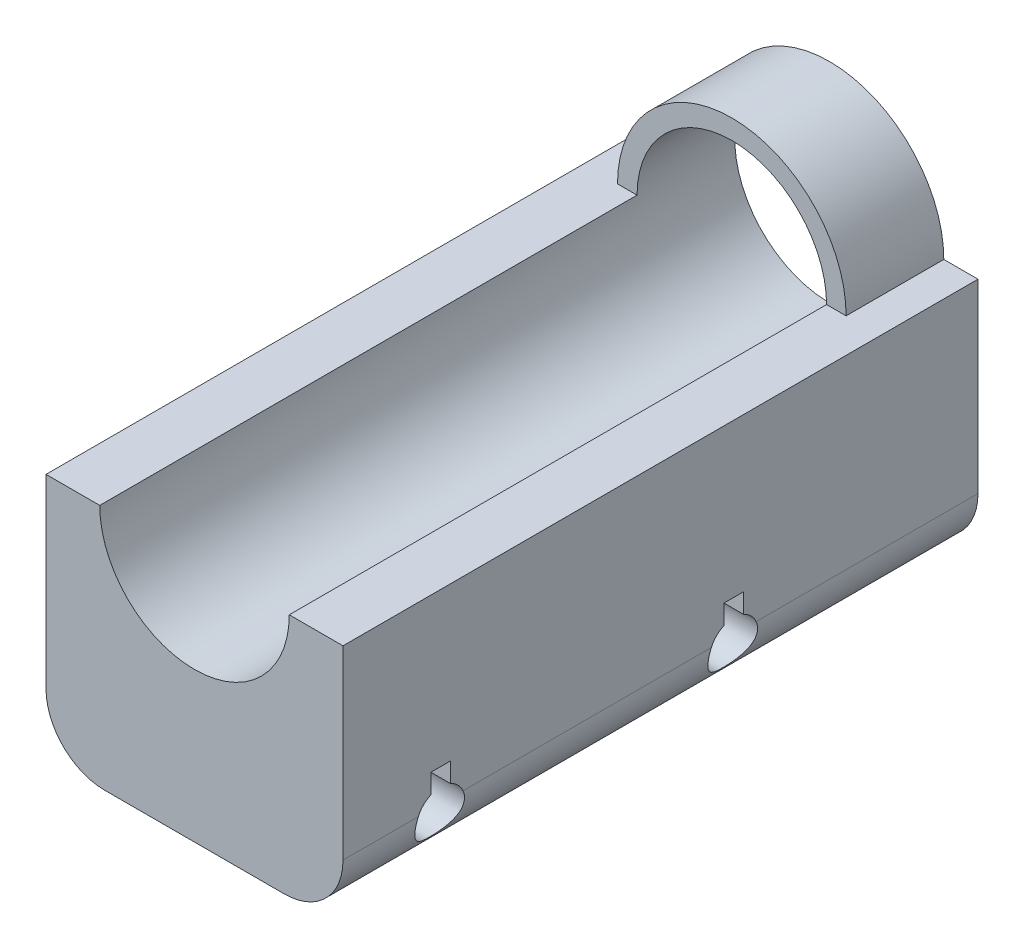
ISO-10303-21;
HEADER;
FILE_DESCRIPTION(('STEP AP214'),'2;1');
FILE_NAME('part.step','',(''),(''),'','','');
FILE_SCHEMA(('AUTOMOTIVE_DESIGN { 1 0 10303 214 1 1 1 1 }'));
ENDSEC;
DATA;
#1=APPLICATION_CONTEXT('core data for automotive mechanical design processes');
#2=APPLICATION_PROTOCOL_DEFINITION('international standard','automotive_design',2000,#1);
#3=PRODUCT_CONTEXT('',#1,'mechanical');
#4=PRODUCT('Part','Part','',(#3));
#5=PRODUCT_RELATED_PRODUCT_CATEGORY('part','',(#4));
#6=PRODUCT_DEFINITION_FORMATION('','',#4);
#7=PRODUCT_DEFINITION_CONTEXT('part definition',#1,'design');
#8=PRODUCT_DEFINITION('design','',#6,#7);
#9=PRODUCT_DEFINITION_SHAPE('','',#8);
#10=(LENGTH_UNIT() NAMED_UNIT(*) SI_UNIT(.MILLI.,.METRE.));
#11=(NAMED_UNIT(*) PLANE_ANGLE_UNIT() SI_UNIT($,.RADIAN.));
#12=(NAMED_UNIT(*) SI_UNIT($,.STERADIAN.) SOLID_ANGLE_UNIT());
#13=UNCERTAINTY_MEASURE_WITH_UNIT(LENGTH_MEASURE(1.E-05),#10,'distance_accuracy_value','');
#14=(GEOMETRIC_REPRESENTATION_CONTEXT(3) GLOBAL_UNCERTAINTY_ASSIGNED_CONTEXT((#13)) GLOBAL_UNIT_ASSIGNED_CONTEXT((#10,
#11,#12)) REPRESENTATION_CONTEXT('',''));
#15=CARTESIAN_POINT('',(0.,0.,0.));
#16=DIRECTION('',(0.,0.,1.));
#17=DIRECTION('',(1.,0.,0.));
#18=AXIS2_PLACEMENT_3D('',#15,#16,#17);
#19=CARTESIAN_POINT('',(38.608,7.62000000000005,82.55));
#20=DIRECTION('',(-1.,0.,0.));
#21=DIRECTION('',(0.,0.,1.));
#22=AXIS2_PLACEMENT_3D('',#19,#20,#21);
#23=PLANE('',#22);
#24=DIRECTION('',(0.,-1.,0.));
#25=VECTOR('',#24,1.);
#26=CARTESIAN_POINT('',(38.608,9.25993556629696,68.58));
#27=LINE('',#26,#25);
#28=CARTESIAN_POINT('',(38.608,11.799935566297,68.58));
#29=VERTEX_POINT('',#28);
#30=CARTESIAN_POINT('',(38.608,9.25993556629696,68.58));
#31=VERTEX_POINT('',#30);
#32=EDGE_CURVE('E193',#29,#31,#27,.T.);
#33=ORIENTED_EDGE('',*,*,#32,.T.);
#34=CARTESIAN_POINT('',(38.608,6.35,69.85));
#35=DIRECTION('',(-1.,0.,0.));
#36=DIRECTION('',(0.,0.,1.));
#37=AXIS2_PLACEMENT_3D('',#34,#35,#36);
#38=CIRCLE('',#37,3.175);
#39=CARTESIAN_POINT('',(38.608,7.62,66.940064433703));
#40=VERTEX_POINT('',#39);
#41=EDGE_CURVE('E202',#31,#40,#38,.T.);
#42=ORIENTED_EDGE('',*,*,#41,.T.);
#43=DIRECTION('',(0.,0.,-1.));
#44=VECTOR('',#43,1.);
#45=CARTESIAN_POINT('',(38.608,7.62000000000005,82.55));
#46=LINE('',#45,#44);
#47=CARTESIAN_POINT('',(38.608,7.62000000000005,34.659935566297));
#48=VERTEX_POINT('',#47);
#49=EDGE_CURVE('E342',#40,#48,#46,.T.);
#50=ORIENTED_EDGE('',*,*,#49,.T.);
#51=CARTESIAN_POINT('',(38.608,6.35,31.75));
#52=DIRECTION('',(-1.,0.,0.));
#53=DIRECTION('',(0.,0.,1.));
#54=AXIS2_PLACEMENT_3D('',#51,#52,#53);
#55=CIRCLE('',#54,3.175);
#56=CARTESIAN_POINT('',(38.608,9.25993556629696,33.02));
#57=VERTEX_POINT('',#56);
#58=EDGE_CURVE('E374',#48,#57,#55,.T.);
#59=ORIENTED_EDGE('',*,*,#58,.T.);
#60=DIRECTION('',(0.,1.,0.));
#61=VECTOR('',#60,1.);
#62=CARTESIAN_POINT('',(38.608,11.799935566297,33.02));
#63=LINE('',#62,#61);
#64=CARTESIAN_POINT('',(38.608,11.799935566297,33.02));
#65=VERTEX_POINT('',#64);
#66=EDGE_CURVE('E378',#57,#65,#63,.T.);
#67=ORIENTED_EDGE('',*,*,#66,.T.);
#68=DIRECTION('',(0.,0.,-1.));
#69=VECTOR('',#68,1.);
#70=CARTESIAN_POINT('',(38.608,11.799935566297,30.48));
#71=LINE('',#70,#69);
#72=CARTESIAN_POINT('',(38.608,11.799935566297,30.48));
#73=VERTEX_POINT('',#72);
#74=EDGE_CURVE('E380',#65,#73,#71,.T.);
#75=ORIENTED_EDGE('',*,*,#74,.T.);
#76=DIRECTION('',(0.,-1.,0.));
#77=VECTOR('',#76,1.);
#78=CARTESIAN_POINT('',(38.608,9.25993556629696,30.48));
#79=LINE('',#78,#77);
#80=CARTESIAN_POINT('',(38.608,9.25993556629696,30.48));
#81=VERTEX_POINT('',#80);
#82=EDGE_CURVE('E377',#73,#81,#79,.T.);
#83=ORIENTED_EDGE('',*,*,#82,.T.);
#84=CARTESIAN_POINT('',(38.608,7.62,28.840064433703));
#85=VERTEX_POINT('',#84);
#86=EDGE_CURVE('E235',#81,#85,#55,.T.);
#87=ORIENTED_EDGE('',*,*,#86,.T.);
#88=CARTESIAN_POINT('',(38.608,7.62000000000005,0.));
#89=VERTEX_POINT('',#88);
#90=EDGE_CURVE('E321',#85,#89,#46,.T.);
#91=ORIENTED_EDGE('',*,*,#90,.T.);
#92=DIRECTION('',(0.,1.,0.));
#93=VECTOR('',#92,1.);
#94=CARTESIAN_POINT('',(38.608,7.62000000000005,0.));
#95=LINE('',#94,#93);
#96=CARTESIAN_POINT('',(38.608,31.75,0.));
#97=VERTEX_POINT('',#96);
#98=EDGE_CURVE('E300',#89,#97,#95,.T.);
#99=ORIENTED_EDGE('',*,*,#98,.T.);
#100=DIRECTION('',(0.,0.,-1.));
#101=VECTOR('',#100,1.);
#102=CARTESIAN_POINT('',(38.608,31.75,82.55));
#103=LINE('',#102,#101);
#104=CARTESIAN_POINT('',(38.608,31.75,82.55));
#105=VERTEX_POINT('',#104);
#106=EDGE_CURVE('E360',#105,#97,#103,.T.);
#107=ORIENTED_EDGE('',*,*,#106,.F.);
#108=DIRECTION('',(0.,1.,0.));
#109=VECTOR('',#108,1.);
#110=CARTESIAN_POINT('',(38.608,7.62000000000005,82.55));
#111=LINE('',#110,#109);
#112=CARTESIAN_POINT('',(38.608,7.62000000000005,82.55));
#113=VERTEX_POINT('',#112);
#114=EDGE_CURVE('E303',#113,#105,#111,.T.);
#115=ORIENTED_EDGE('',*,*,#114,.F.);
#116=CARTESIAN_POINT('',(38.608,7.62000000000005,72.7599355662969));
#117=VERTEX_POINT('',#116);
#118=EDGE_CURVE('E208',#113,#117,#46,.T.);
#119=ORIENTED_EDGE('',*,*,#118,.T.);
#120=CARTESIAN_POINT('',(38.608,9.25993556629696,71.12));
#121=VERTEX_POINT('',#120);
#122=EDGE_CURVE('E61',#117,#121,#38,.T.);
#123=ORIENTED_EDGE('',*,*,#122,.T.);
#124=DIRECTION('',(0.,1.,0.));
#125=VECTOR('',#124,1.);
#126=CARTESIAN_POINT('',(38.608,11.799935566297,71.12));
#127=LINE('',#126,#125);
#128=CARTESIAN_POINT('',(38.608,11.799935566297,71.12));
#129=VERTEX_POINT('',#128);
#130=EDGE_CURVE('E196',#121,#129,#127,.T.);
#131=ORIENTED_EDGE('',*,*,#130,.T.);
#132=DIRECTION('',(0.,0.,-1.));
#133=VECTOR('',#132,1.);
#134=CARTESIAN_POINT('',(38.608,11.799935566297,68.58));
#135=LINE('',#134,#133);
#136=EDGE_CURVE('E201',#129,#29,#135,.T.);
#137=ORIENTED_EDGE('',*,*,#136,.T.);
#138=EDGE_LOOP('',(#33,#42,#50,#59,#67,#75,#83,#87,#91,#99,#107,#115,#119,#123,#131,#137));
#139=FACE_BOUND('',#138,.T.);
#140=ADVANCED_FACE('F35',(#139),#23,.F.);
#141=CARTESIAN_POINT('',(31.623,31.75,82.55));
#142=DIRECTION('',(0.,-1.,0.));
#143=DIRECTION('',(0.,0.,-1.));
#144=AXIS2_PLACEMENT_3D('',#141,#142,#143);
#145=PLANE('',#144);
#146=DIRECTION('',(-1.,0.,0.));
#147=VECTOR('',#146,1.);
#148=CARTESIAN_POINT('',(31.623,31.75,0.));
#149=LINE('',#148,#147);
#150=CARTESIAN_POINT('',(34.163,31.75,0.));
#151=VERTEX_POINT('',#150);
#152=EDGE_CURVE('E324',#97,#151,#149,.T.);
#153=ORIENTED_EDGE('',*,*,#152,.T.);
#154=DIRECTION('',(0.,0.,-1.));
#155=VECTOR('',#154,1.);
#156=CARTESIAN_POINT('',(34.163,31.75,12.7));
#157=LINE('',#156,#155);
#158=CARTESIAN_POINT('',(34.163,31.75,12.7));
#159=VERTEX_POINT('',#158);
#160=EDGE_CURVE('E294',#159,#151,#157,.T.);
#161=ORIENTED_EDGE('',*,*,#160,.F.);
#162=DIRECTION('',(-1.,0.,0.));
#163=VECTOR('',#162,1.);
#164=CARTESIAN_POINT('',(31.623,31.75,12.7));
#165=LINE('',#164,#163);
#166=CARTESIAN_POINT('',(31.623,31.75,12.7));
#167=VERTEX_POINT('',#166);
#168=EDGE_CURVE('E287',#159,#167,#165,.T.);
#169=ORIENTED_EDGE('',*,*,#168,.T.);
#170=DIRECTION('',(0.,0.,-1.));
#171=VECTOR('',#170,1.);
#172=CARTESIAN_POINT('',(31.623,31.75,82.55));
#173=LINE('',#172,#171);
#174=CARTESIAN_POINT('',(31.623,31.75,82.55));
#175=VERTEX_POINT('',#174);
#176=EDGE_CURVE('E358',#175,#167,#173,.T.);
#177=ORIENTED_EDGE('',*,*,#176,.F.);
#178=DIRECTION('',(-1.,0.,0.));
#179=VECTOR('',#178,1.);
#180=CARTESIAN_POINT('',(31.623,31.75,82.55));
#181=LINE('',#180,#179);
#182=EDGE_CURVE('E306',#105,#175,#181,.T.);
#183=ORIENTED_EDGE('',*,*,#182,.F.);
#184=ORIENTED_EDGE('',*,*,#106,.T.);
#185=EDGE_LOOP('',(#153,#161,#169,#177,#183,#184));
#186=FACE_BOUND('',#185,.T.);
#187=ADVANCED_FACE('F441',(#186),#145,.F.);
#188=CARTESIAN_POINT('',(19.304,31.75,82.55));
#189=DIRECTION('',(0.,0.,-1.));
#190=DIRECTION('',(-1.,0.,0.));
#191=AXIS2_PLACEMENT_3D('',#188,#189,#190);
#192=CYLINDRICAL_SURFACE('',#191,12.319);
#193=CARTESIAN_POINT('',(19.304,31.75,0.));
#194=DIRECTION('',(0.,0.,-1.));
#195=DIRECTION('',(1.,0.,0.));
#196=AXIS2_PLACEMENT_3D('',#193,#194,#195);
#197=CIRCLE('',#196,12.319);
#198=CARTESIAN_POINT('',(31.623,31.75,0.));
#199=VERTEX_POINT('',#198);
#200=EDGE_CURVE('E326',#199,#199,#197,.T.);
#201=ORIENTED_EDGE('',*,*,#200,.T.);
#202=EDGE_LOOP('',(#201));
#203=FACE_BOUND('',#202,.T.);
#204=ORIENTED_EDGE('',*,*,#176,.T.);
#205=CARTESIAN_POINT('',(19.304,31.75,12.7));
#206=DIRECTION('',(0.,0.,1.));
#207=DIRECTION('',(-1.,0.,0.));
#208=AXIS2_PLACEMENT_3D('',#205,#206,#207);
#209=CIRCLE('',#208,12.319);
#210=CARTESIAN_POINT('',(6.985,31.75,12.7));
#211=VERTEX_POINT('',#210);
#212=EDGE_CURVE('E289',#167,#211,#209,.T.);
#213=ORIENTED_EDGE('',*,*,#212,.T.);
#214=DIRECTION('',(0.,0.,-1.));
#215=VECTOR('',#214,1.);
#216=CARTESIAN_POINT('',(6.985,31.75,82.55));
#217=LINE('',#216,#215);
#218=CARTESIAN_POINT('',(6.985,31.75,82.55));
#219=VERTEX_POINT('',#218);
#220=EDGE_CURVE('E356',#219,#211,#217,.T.);
#221=ORIENTED_EDGE('',*,*,#220,.F.);
#222=CARTESIAN_POINT('',(19.304,31.75,82.55));
#223=DIRECTION('',(0.,0.,-1.));
#224=DIRECTION('',(1.,0.,0.));
#225=AXIS2_PLACEMENT_3D('',#222,#223,#224);
#226=CIRCLE('',#225,12.319);
#227=EDGE_CURVE('E309',#175,#219,#226,.T.);
#228=ORIENTED_EDGE('',*,*,#227,.F.);
#229=EDGE_LOOP('',(#204,#213,#221,#228));
#230=FACE_BOUND('',#229,.T.);
#231=ADVANCED_FACE('F445',(#203,#230),#192,.F.);
#232=CARTESIAN_POINT('',(0.,31.75,82.55));
#233=DIRECTION('',(0.,-1.,0.));
#234=DIRECTION('',(0.,0.,-1.));
#235=AXIS2_PLACEMENT_3D('',#232,#233,#234);
#236=PLANE('',#235);
#237=DIRECTION('',(-1.,0.,0.));
#238=VECTOR('',#237,1.);
#239=CARTESIAN_POINT('',(4.445,31.75,12.7));
#240=LINE('',#239,#238);
#241=CARTESIAN_POINT('',(4.445,31.75,12.7));
#242=VERTEX_POINT('',#241);
#243=EDGE_CURVE('E292',#211,#242,#240,.T.);
#244=ORIENTED_EDGE('',*,*,#243,.T.);
#245=DIRECTION('',(0.,0.,-1.));
#246=VECTOR('',#245,1.);
#247=CARTESIAN_POINT('',(4.445,31.75,12.7));
#248=LINE('',#247,#246);
#249=CARTESIAN_POINT('',(4.445,31.75,0.));
#250=VERTEX_POINT('',#249);
#251=EDGE_CURVE('E297',#242,#250,#248,.T.);
#252=ORIENTED_EDGE('',*,*,#251,.T.);
#253=DIRECTION('',(-1.,0.,0.));
#254=VECTOR('',#253,1.);
#255=CARTESIAN_POINT('',(0.,31.75,0.));
#256=LINE('',#255,#254);
#257=CARTESIAN_POINT('',(0.,31.75,0.));
#258=VERTEX_POINT('',#257);
#259=EDGE_CURVE('E329',#250,#258,#256,.T.);
#260=ORIENTED_EDGE('',*,*,#259,.T.);
#261=DIRECTION('',(0.,0.,-1.));
#262=VECTOR('',#261,1.);
#263=CARTESIAN_POINT('',(0.,31.75,82.55));
#264=LINE('',#263,#262);
#265=CARTESIAN_POINT('',(0.,31.75,82.55));
#266=VERTEX_POINT('',#265);
#267=EDGE_CURVE('E352',#266,#258,#264,.T.);
#268=ORIENTED_EDGE('',*,*,#267,.F.);
#269=DIRECTION('',(-1.,0.,0.));
#270=VECTOR('',#269,1.);
#271=CARTESIAN_POINT('',(0.,31.75,82.55));
#272=LINE('',#271,#270);
#273=EDGE_CURVE('E311',#219,#266,#272,.T.);
#274=ORIENTED_EDGE('',*,*,#273,.F.);
#275=ORIENTED_EDGE('',*,*,#220,.T.);
#276=EDGE_LOOP('',(#244,#252,#260,#268,#274,#275));
#277=FACE_BOUND('',#276,.T.);
#278=ADVANCED_FACE('F449',(#277),#236,.F.);
#279=CARTESIAN_POINT('',(0.,7.62000000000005,82.55));
#280=DIRECTION('',(1.,0.,0.));
#281=DIRECTION('',(0.,0.,-1.));
#282=AXIS2_PLACEMENT_3D('',#279,#280,#281);
#283=PLANE('',#282);
#284=DIRECTION('',(0.,1.,0.));
#285=VECTOR('',#284,1.);
#286=CARTESIAN_POINT('',(0.,11.799935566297,71.12));
#287=LINE('',#286,#285);
#288=CARTESIAN_POINT('',(0.,9.25993556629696,71.12));
#289=VERTEX_POINT('',#288);
#290=CARTESIAN_POINT('',(0.,11.799935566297,71.12));
#291=VERTEX_POINT('',#290);
#292=EDGE_CURVE('E219',#289,#291,#287,.T.);
#293=ORIENTED_EDGE('',*,*,#292,.F.);
#294=CARTESIAN_POINT('',(0.,6.35,69.85));
#295=DIRECTION('',(-1.,0.,0.));
#296=DIRECTION('',(0.,0.,1.));
#297=AXIS2_PLACEMENT_3D('',#294,#295,#296);
#298=CIRCLE('',#297,3.175);
#299=CARTESIAN_POINT('',(0.,7.62,72.7599355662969));
#300=VERTEX_POINT('',#299);
#301=EDGE_CURVE('E188',#300,#289,#298,.T.);
#302=ORIENTED_EDGE('',*,*,#301,.F.);
#303=DIRECTION('',(0.,0.,-1.));
#304=VECTOR('',#303,1.);
#305=CARTESIAN_POINT('',(0.,7.62000000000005,82.55));
#306=LINE('',#305,#304);
#307=CARTESIAN_POINT('',(0.,7.62000000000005,82.55));
#308=VERTEX_POINT('',#307);
#309=EDGE_CURVE('E349',#308,#300,#306,.T.);
#310=ORIENTED_EDGE('',*,*,#309,.F.);
#311=DIRECTION('',(0.,-1.,0.));
#312=VECTOR('',#311,1.);
#313=CARTESIAN_POINT('',(0.,7.62000000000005,82.55));
#314=LINE('',#313,#312);
#315=EDGE_CURVE('E313',#266,#308,#314,.T.);
#316=ORIENTED_EDGE('',*,*,#315,.F.);
#317=ORIENTED_EDGE('',*,*,#267,.T.);
#318=DIRECTION('',(0.,-1.,0.));
#319=VECTOR('',#318,1.);
#320=CARTESIAN_POINT('',(0.,7.62000000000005,0.));
#321=LINE('',#320,#319);
#322=CARTESIAN_POINT('',(0.,7.62000000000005,0.));
#323=VERTEX_POINT('',#322);
#324=EDGE_CURVE('E331',#258,#323,#321,.T.);
#325=ORIENTED_EDGE('',*,*,#324,.T.);
#326=CARTESIAN_POINT('',(0.,7.62000000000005,28.840064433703));
#327=VERTEX_POINT('',#326);
#328=EDGE_CURVE('E348',#327,#323,#306,.T.);
#329=ORIENTED_EDGE('',*,*,#328,.F.);
#330=CARTESIAN_POINT('',(0.,6.35,31.75));
#331=DIRECTION('',(-1.,0.,0.));
#332=DIRECTION('',(0.,0.,1.));
#333=AXIS2_PLACEMENT_3D('',#330,#331,#332);
#334=CIRCLE('',#333,3.175);
#335=CARTESIAN_POINT('',(0.,9.25993556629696,30.48));
#336=VERTEX_POINT('',#335);
#337=EDGE_CURVE('E403',#336,#327,#334,.T.);
#338=ORIENTED_EDGE('',*,*,#337,.F.);
#339=DIRECTION('',(0.,-1.,0.));
#340=VECTOR('',#339,1.);
#341=CARTESIAN_POINT('',(0.,9.25993556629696,30.48));
#342=LINE('',#341,#340);
#343=CARTESIAN_POINT('',(0.,11.799935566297,30.48));
#344=VERTEX_POINT('',#343);
#345=EDGE_CURVE('E381',#344,#336,#342,.T.);
#346=ORIENTED_EDGE('',*,*,#345,.F.);
#347=DIRECTION('',(0.,0.,-1.));
#348=VECTOR('',#347,1.);
#349=CARTESIAN_POINT('',(0.,11.799935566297,30.48));
#350=LINE('',#349,#348);
#351=CARTESIAN_POINT('',(0.,11.799935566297,33.02));
#352=VERTEX_POINT('',#351);
#353=EDGE_CURVE('E383',#352,#344,#350,.T.);
#354=ORIENTED_EDGE('',*,*,#353,.F.);
#355=DIRECTION('',(0.,1.,0.));
#356=VECTOR('',#355,1.);
#357=CARTESIAN_POINT('',(0.,11.799935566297,33.02));
#358=LINE('',#357,#356);
#359=CARTESIAN_POINT('',(0.,9.25993556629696,33.02));
#360=VERTEX_POINT('',#359);
#361=EDGE_CURVE('E388',#360,#352,#358,.T.);
#362=ORIENTED_EDGE('',*,*,#361,.F.);
#363=CARTESIAN_POINT('',(0.,7.62,34.659935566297));
#364=VERTEX_POINT('',#363);
#365=EDGE_CURVE('E234',#364,#360,#334,.T.);
#366=ORIENTED_EDGE('',*,*,#365,.F.);
#367=CARTESIAN_POINT('',(0.,7.62000000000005,66.940064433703));
#368=VERTEX_POINT('',#367);
#369=EDGE_CURVE('E353',#368,#364,#306,.T.);
#370=ORIENTED_EDGE('',*,*,#369,.F.);
#371=CARTESIAN_POINT('',(0.,9.25993556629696,68.58));
#372=VERTEX_POINT('',#371);
#373=EDGE_CURVE('E54',#372,#368,#298,.T.);
#374=ORIENTED_EDGE('',*,*,#373,.F.);
#375=DIRECTION('',(0.,-1.,0.));
#376=VECTOR('',#375,1.);
#377=CARTESIAN_POINT('',(0.,9.25993556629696,68.58));
#378=LINE('',#377,#376);
#379=CARTESIAN_POINT('',(0.,11.799935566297,68.58));
#380=VERTEX_POINT('',#379);
#381=EDGE_CURVE('E209',#380,#372,#378,.T.);
#382=ORIENTED_EDGE('',*,*,#381,.F.);
#383=DIRECTION('',(0.,0.,-1.));
#384=VECTOR('',#383,1.);
#385=CARTESIAN_POINT('',(0.,11.799935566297,68.58));
#386=LINE('',#385,#384);
#387=EDGE_CURVE('E213',#291,#380,#386,.T.);
#388=ORIENTED_EDGE('',*,*,#387,.F.);
#389=EDGE_LOOP('',(#293,#302,#310,#316,#317,#325,#329,#338,#346,#354,#362,#366,#370,#374,#382,#388));
#390=FACE_BOUND('',#389,.T.);
#391=ADVANCED_FACE('F407',(#390),#283,.F.);
#392=CARTESIAN_POINT('',(7.62,7.62,82.55));
#393=DIRECTION('',(0.,0.,-1.));
#394=DIRECTION('',(-1.,0.,0.));
#395=AXIS2_PLACEMENT_3D('',#392,#393,#394);
#396=CYLINDRICAL_SURFACE('',#395,7.62);
#397=ORIENTED_EDGE('',*,*,#309,.T.);
#398=CARTESIAN_POINT('',(0.178561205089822,9.25993556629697,71.12));
#399=CARTESIAN_POINT('',(0.170687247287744,9.22418125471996,71.2019183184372));
#400=CARTESIAN_POINT('',(0.162318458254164,9.18500593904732,71.2822445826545));
#401=CARTESIAN_POINT('',(0.144994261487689,9.10006394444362,71.4392607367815));
#402=CARTESIAN_POINT('',(0.13603889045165,9.05429767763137,71.515950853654));
#403=CARTESIAN_POINT('',(0.108897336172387,8.90748937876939,71.7398909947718));
#404=CARTESIAN_POINT('',(0.0904342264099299,8.79693164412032,71.8810249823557));
#405=CARTESIAN_POINT('',(0.0563898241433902,8.55343318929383,72.1429323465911));
#406=CARTESIAN_POINT('',(0.0408104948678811,8.42047733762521,72.2636918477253));
#407=CARTESIAN_POINT('',(0.0161377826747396,8.13578269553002,72.4812817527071));
#408=CARTESIAN_POINT('',(0.007039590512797,7.98405793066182,72.5781298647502));
#409=CARTESIAN_POINT('',(-0.00142698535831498,7.66952754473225,72.743155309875));
#410=CARTESIAN_POINT('',(-0.000995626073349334,7.5070214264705,72.8118918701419));
#411=CARTESIAN_POINT('',(0.0112778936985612,7.17324843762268,72.9214348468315));
#412=CARTESIAN_POINT('',(0.0231180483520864,7.00198311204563,72.962246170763));
#413=CARTESIAN_POINT('',(0.0582997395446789,6.66478635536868,73.0137339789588));
#414=CARTESIAN_POINT('',(0.0810545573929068,6.49900002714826,73.0257781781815));
#415=CARTESIAN_POINT('',(0.13746797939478,6.16946058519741,73.0241434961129));
#416=CARTESIAN_POINT('',(0.171126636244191,6.00570748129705,73.0104644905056));
#417=CARTESIAN_POINT('',(0.248475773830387,5.68275497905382,72.95845050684));
#418=CARTESIAN_POINT('',(0.292270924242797,5.52362408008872,72.9198501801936));
#419=CARTESIAN_POINT('',(0.387599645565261,5.21523928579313,72.8197229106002));
#420=CARTESIAN_POINT('',(0.439135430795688,5.06598823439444,72.7581893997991));
#421=CARTESIAN_POINT('',(0.552125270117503,4.76742260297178,72.6079701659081));
#422=CARTESIAN_POINT('',(0.614052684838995,4.61924758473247,72.5173782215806));
#423=CARTESIAN_POINT('',(0.740312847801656,4.34008720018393,72.3138909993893));
#424=CARTESIAN_POINT('',(0.804647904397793,4.20911890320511,72.2009738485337));
#425=CARTESIAN_POINT('',(0.937274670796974,3.95559602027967,71.9435668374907));
#426=CARTESIAN_POINT('',(1.00538882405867,3.83491176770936,71.7971321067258));
#427=CARTESIAN_POINT('',(1.1329481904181,3.62022940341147,71.4825265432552));
#428=CARTESIAN_POINT('',(1.19240285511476,3.52620208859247,71.3143797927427));
#429=CARTESIAN_POINT('',(1.28400010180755,3.38621737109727,70.9987075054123));
#430=CARTESIAN_POINT('',(1.31927326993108,3.33423818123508,70.8547624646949));
#431=CARTESIAN_POINT('',(1.37652950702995,3.25124184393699,70.5584642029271));
#432=CARTESIAN_POINT('',(1.39852815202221,3.22020012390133,70.4061210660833));
#433=CARTESIAN_POINT('',(1.42664333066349,3.18070302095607,70.0962997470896));
#434=CARTESIAN_POINT('',(1.43268550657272,3.17235337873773,69.9388009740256));
#435=CARTESIAN_POINT('',(1.42782983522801,3.17911695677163,69.6245567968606));
#436=CARTESIAN_POINT('',(1.41693001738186,3.19423290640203,69.4678114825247));
#437=CARTESIAN_POINT('',(1.38100791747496,3.24504530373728,69.1710671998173));
#438=CARTESIAN_POINT('',(1.35703987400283,3.27920927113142,69.0306682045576));
#439=CARTESIAN_POINT('',(1.29823318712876,3.36531239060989,68.7578710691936));
#440=CARTESIAN_POINT('',(1.26339084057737,3.41725759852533,68.6254756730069));
#441=CARTESIAN_POINT('',(1.18180469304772,3.54321184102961,68.3578179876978));
#442=CARTESIAN_POINT('',(1.1342137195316,3.61892074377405,68.2236194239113));
#443=CARTESIAN_POINT('',(1.03313325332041,3.78760347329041,67.9690148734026));
#444=CARTESIAN_POINT('',(0.979640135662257,3.88058793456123,67.8486174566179));
#445=CARTESIAN_POINT('',(0.860551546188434,4.09972005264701,67.6031236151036));
#446=CARTESIAN_POINT('',(0.794475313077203,4.22882351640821,67.4808859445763));
#447=CARTESIAN_POINT('',(0.663624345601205,4.50603828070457,67.2592572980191));
#448=CARTESIAN_POINT('',(0.598850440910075,4.65416128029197,67.1598804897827));
#449=CARTESIAN_POINT('',(0.470636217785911,4.97742770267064,66.9806684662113));
#450=CARTESIAN_POINT('',(0.407582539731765,5.15372115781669,66.9026099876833));
#451=CARTESIAN_POINT('',(0.292360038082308,5.52071969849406,66.7791169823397));
#452=CARTESIAN_POINT('',(0.240183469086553,5.71141439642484,66.7336591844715));
#453=CARTESIAN_POINT('',(0.153749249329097,6.08589325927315,66.6808108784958));
#454=CARTESIAN_POINT('',(0.118404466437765,6.26903999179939,66.6707057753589));
#455=CARTESIAN_POINT('',(0.0614667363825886,6.63641065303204,66.6826187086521));
#456=CARTESIAN_POINT('',(0.0398657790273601,6.82063389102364,66.7046180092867));
#457=CARTESIAN_POINT('',(0.0117018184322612,7.16661438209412,66.7772008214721));
#458=CARTESIAN_POINT('',(0.00393423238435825,7.32887516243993,66.8249568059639));
#459=CARTESIAN_POINT('',(-0.00159055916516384,7.64386153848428,66.9456951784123));
#460=CARTESIAN_POINT('',(0.000650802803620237,7.79658849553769,67.01867395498));
#461=CARTESIAN_POINT('',(0.0129585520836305,8.0873278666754,67.1872221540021));
#462=CARTESIAN_POINT('',(0.0229754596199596,8.22542707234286,67.2826460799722));
#463=CARTESIAN_POINT('',(0.0480941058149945,8.48465778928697,67.4937658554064));
#464=CARTESIAN_POINT('',(0.0631983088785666,8.60578103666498,67.6094715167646));
#465=CARTESIAN_POINT('',(0.0957007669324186,8.82921239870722,67.8594129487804));
#466=CARTESIAN_POINT('',(0.113117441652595,8.931351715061,67.9937979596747));
#467=CARTESIAN_POINT('',(0.138623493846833,9.06760000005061,68.2061113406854));
#468=CARTESIAN_POINT('',(0.147023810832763,9.11019546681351,68.2786858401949));
#469=CARTESIAN_POINT('',(0.163282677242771,9.18951884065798,68.4270363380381));
#470=CARTESIAN_POINT('',(0.171141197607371,9.22624643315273,68.5028125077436));
#471=CARTESIAN_POINT('',(0.17856120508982,9.25993556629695,68.58));
#472=B_SPLINE_CURVE_WITH_KNOTS('',3,(#398,#399,#400,#401,#402,#403,#404,#405,#406,#407,#408,
#409,#410,#411,#412,#413,#414,#415,#416,#417,#418,#419,#420,#421,#422,#423,#424,#425,#426,#427,
#428,#429,#430,#431,#432,#433,#434,#435,#436,#437,#438,#439,#440,#441,#442,#443,#444,#445,#446,
#447,#448,#449,#450,#451,#452,#453,#454,#455,#456,#457,#458,#459,#460,#461,#462,#463,#464,#465,
#466,#467,#468,#469,#470,#471),.UNSPECIFIED.,.F.,.F.,(4,2,2,2,2,2,2,2,2,2,2,2,2,2,2,2,2,2,2,2,2,
2,2,2,2,2,2,2,2,2,2,2,2,2,2,2,4),(0.,0.269010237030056,0.538003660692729,1.07594446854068,
1.61425016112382,2.1521559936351,2.67876906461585,3.20528956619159,3.70623009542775,
4.20717304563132,4.71353974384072,5.22005157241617,5.77093015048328,6.32235114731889,
6.92429489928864,7.52557664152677,7.9948148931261,8.46350147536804,8.93436833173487,
9.40528996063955,9.84287841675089,10.2806160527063,10.7626149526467,11.2449115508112,
11.8115315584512,12.3785017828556,12.9838266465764,13.5887189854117,14.1460013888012,
14.7029586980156,15.2084783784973,15.7139257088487,16.2161827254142,16.7186833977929,
17.2254581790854,17.4789370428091,17.7324294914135),.UNSPECIFIED.);
#473=EDGE_CURVE('E225',#300,#368,#472,.T.);
#474=ORIENTED_EDGE('',*,*,#473,.T.);
#475=ORIENTED_EDGE('',*,*,#369,.T.);
#476=CARTESIAN_POINT('',(0.,7.62000000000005,34.6599355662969));
#477=CARTESIAN_POINT('',(-1.01860033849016E-05,7.54310146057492,34.6935092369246));
#478=CARTESIAN_POINT('',(0.00116381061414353,7.46486233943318,34.7240141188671));
#479=CARTESIAN_POINT('',(0.00604976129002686,7.30629051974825,34.7787207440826));
#480=CARTESIAN_POINT('',(0.0097616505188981,7.22595787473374,34.802922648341));
#481=CARTESIAN_POINT('',(0.019879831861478,7.06399276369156,34.8448051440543));
#482=CARTESIAN_POINT('',(0.0262791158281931,6.98236420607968,34.8625024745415));
#483=CARTESIAN_POINT('',(0.0418466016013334,6.81825024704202,34.8913881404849));
#484=CARTESIAN_POINT('',(0.0510146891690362,6.73576488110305,34.9025767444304));
#485=CARTESIAN_POINT('',(0.0827431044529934,6.48783975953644,34.9263375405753));
#486=CARTESIAN_POINT('',(0.109530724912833,6.32187885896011,34.9291180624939));
#487=CARTESIAN_POINT('',(0.17368785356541,5.99369136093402,34.9092345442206));
#488=CARTESIAN_POINT('',(0.211059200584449,5.83146541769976,34.8865660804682));
#489=CARTESIAN_POINT('',(0.295625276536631,5.51148135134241,34.816732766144));
#490=CARTESIAN_POINT('',(0.343000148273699,5.35387567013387,34.7690909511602));
#491=CARTESIAN_POINT('',(0.444747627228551,5.04980282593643,34.6511630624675));
#492=CARTESIAN_POINT('',(0.499123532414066,4.90334096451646,34.5808662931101));
#493=CARTESIAN_POINT('',(0.617515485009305,4.61053631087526,34.4119802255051));
#494=CARTESIAN_POINT('',(0.681955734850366,4.46555903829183,34.3113204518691));
#495=CARTESIAN_POINT('',(0.81179349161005,4.19430496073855,34.0876387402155));
#496=CARTESIAN_POINT('',(0.877191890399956,4.06804697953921,33.9645945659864));
#497=CARTESIAN_POINT('',(1.0091828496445,3.82767662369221,33.6877085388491));
#498=CARTESIAN_POINT('',(1.07546771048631,3.715290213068,33.5322092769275));
#499=CARTESIAN_POINT('',(1.19663388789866,3.51901113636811,33.2002261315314));
#500=CARTESIAN_POINT('',(1.25153342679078,3.43507280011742,33.023776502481));
#501=CARTESIAN_POINT('',(1.33114003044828,3.31669598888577,32.6995930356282));
#502=CARTESIAN_POINT('',(1.35995102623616,3.27516303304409,32.5554528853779));
#503=CARTESIAN_POINT('',(1.40372888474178,3.21274938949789,32.260779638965));
#504=CARTESIAN_POINT('',(1.41871126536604,3.19184555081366,32.1102539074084));
#505=CARTESIAN_POINT('',(1.43303693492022,3.17184792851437,31.8065432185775));
#506=CARTESIAN_POINT('',(1.43233387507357,3.17281878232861,31.6533517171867));
#507=CARTESIAN_POINT('',(1.41526521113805,3.19666829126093,31.3495506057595));
#508=CARTESIAN_POINT('',(1.39889332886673,3.21955572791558,31.1989420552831));
#509=CARTESIAN_POINT('',(1.35338696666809,3.28462937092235,30.9102279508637));
#510=CARTESIAN_POINT('',(1.32476099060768,3.32604934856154,30.7718647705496));
#511=CARTESIAN_POINT('',(1.25763567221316,3.42615483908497,30.504124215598));
#512=CARTESIAN_POINT('',(1.21913294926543,3.48484626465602,30.3747499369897));
#513=CARTESIAN_POINT('',(1.12977642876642,3.62634809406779,30.1106048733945));
#514=CARTESIAN_POINT('',(1.07796861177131,3.71129859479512,29.9773079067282));
#515=CARTESIAN_POINT('',(0.969518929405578,3.89881182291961,29.7259139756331));
#516=CARTESIAN_POINT('',(0.912873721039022,4.00138678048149,29.6078276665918));
#517=CARTESIAN_POINT('',(0.78872434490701,4.24077792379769,29.3699074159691));
#518=CARTESIAN_POINT('',(0.720983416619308,4.38045167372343,29.2530604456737));
#519=CARTESIAN_POINT('',(0.588591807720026,4.67886345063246,29.0442562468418));
#520=CARTESIAN_POINT('',(0.523942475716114,4.83760969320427,28.952309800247));
#521=CARTESIAN_POINT('',(0.43150975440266,5.09047158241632,28.833954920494));
#522=CARTESIAN_POINT('',(0.400961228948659,5.17891192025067,28.7973046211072));
#523=CARTESIAN_POINT('',(0.342404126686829,5.35947303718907,28.7319399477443));
#524=CARTESIAN_POINT('',(0.314394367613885,5.45159207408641,28.7032218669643));
#525=CARTESIAN_POINT('',(0.261399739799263,5.63886993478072,28.6541494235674));
#526=CARTESIAN_POINT('',(0.236414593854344,5.7340284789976,28.6337942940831));
#527=CARTESIAN_POINT('',(0.189889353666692,5.92658480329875,28.6018481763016));
#528=CARTESIAN_POINT('',(0.168347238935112,6.02398123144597,28.5902520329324));
#529=CARTESIAN_POINT('',(0.130836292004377,6.21107476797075,28.5767857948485));
#530=CARTESIAN_POINT('',(0.114535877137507,6.30064827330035,28.5741134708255));
#531=CARTESIAN_POINT('',(0.0851810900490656,6.4801879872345,28.5764010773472));
#532=CARTESIAN_POINT('',(0.0721250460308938,6.57015396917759,28.5813570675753));
#533=CARTESIAN_POINT('',(0.049325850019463,6.74967077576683,28.5989659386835));
#534=CARTESIAN_POINT('',(0.0395797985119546,6.83922189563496,28.6116120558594));
#535=CARTESIAN_POINT('',(0.0233580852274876,7.01716489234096,28.6445694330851));
#536=CARTESIAN_POINT('',(0.0168809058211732,7.10555728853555,28.66487712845));
#537=CARTESIAN_POINT('',(0.00788536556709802,7.26583640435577,28.7090170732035));
#538=CARTESIAN_POINT('',(0.00488685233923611,7.33801677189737,28.7316962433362));
#539=CARTESIAN_POINT('',(0.000942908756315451,7.48048935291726,28.7821170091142));
#540=CARTESIAN_POINT('',(-6.44172894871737E-06,7.55078491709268,28.8098488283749));
#541=CARTESIAN_POINT('',(0.,7.62000000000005,28.8400644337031));
#542=B_SPLINE_CURVE_WITH_KNOTS('',3,(#476,#477,#478,#479,#480,#481,#482,#483,#484,#485,#486,
#487,#488,#489,#490,#491,#492,#493,#494,#495,#496,#497,#498,#499,#500,#501,#502,#503,#504,#505,
#506,#507,#508,#509,#510,#511,#512,#513,#514,#515,#516,#517,#518,#519,#520,#521,#522,#523,#524,
#525,#526,#527,#528,#529,#530,#531,#532,#533,#534,#535,#536,#537,#538,#539,#540,#541),
.UNSPECIFIED.,.F.,.F.,(4,2,2,2,2,2,2,2,2,2,2,2,2,2,2,2,2,2,2,2,2,2,2,2,2,2,2,2,2,2,2,2,4),(0.,
0.251650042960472,0.503293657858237,0.754285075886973,1.00526613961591,1.50706866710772,
2.00895843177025,2.52080311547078,3.03288980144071,3.59421465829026,4.15610019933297,
4.76199703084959,5.3669165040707,5.82323689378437,6.27904459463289,6.73619933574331,
7.19353732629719,7.63350025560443,8.07361397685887,8.57076979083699,9.06827200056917,
9.64866568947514,10.2293102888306,10.530434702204,10.8314181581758,11.1323740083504,
11.4331525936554,11.7060381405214,11.9787827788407,12.2512878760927,12.5236663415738,
12.7506073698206,12.9771138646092),.UNSPECIFIED.);
#543=EDGE_CURVE('E273',#364,#327,#542,.T.);
#544=ORIENTED_EDGE('',*,*,#543,.T.);
#545=ORIENTED_EDGE('',*,*,#328,.T.);
#546=CARTESIAN_POINT('',(7.62,7.62,0.));
#547=DIRECTION('',(0.,0.,1.));
#548=DIRECTION('',(-1.,0.,0.));
#549=AXIS2_PLACEMENT_3D('',#546,#547,#548);
#550=CIRCLE('',#549,7.62);
#551=CARTESIAN_POINT('',(7.62000000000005,0.,0.));
#552=VERTEX_POINT('',#551);
#553=EDGE_CURVE('E334',#323,#552,#550,.T.);
#554=ORIENTED_EDGE('',*,*,#553,.T.);
#555=DIRECTION('',(0.,0.,-1.));
#556=VECTOR('',#555,1.);
#557=CARTESIAN_POINT('',(7.62000000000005,0.,82.55));
#558=LINE('',#557,#556);
#559=CARTESIAN_POINT('',(7.62000000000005,0.,82.55));
#560=VERTEX_POINT('',#559);
#561=EDGE_CURVE('E345',#560,#552,#558,.T.);
#562=ORIENTED_EDGE('',*,*,#561,.F.);
#563=CARTESIAN_POINT('',(7.62,7.62,82.55));
#564=DIRECTION('',(0.,0.,1.));
#565=DIRECTION('',(-1.,0.,0.));
#566=AXIS2_PLACEMENT_3D('',#563,#564,#565);
#567=CIRCLE('',#566,7.62);
#568=EDGE_CURVE('E315',#308,#560,#567,.T.);
#569=ORIENTED_EDGE('',*,*,#568,.F.);
#570=EDGE_LOOP('',(#397,#474,#475,#544,#545,#554,#562,#569));
#571=FACE_BOUND('',#570,.T.);
#572=ADVANCED_FACE('F237',(#571),#396,.T.);
#573=CARTESIAN_POINT('',(7.62000000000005,0.,82.55));
#574=DIRECTION('',(0.,1.,0.));
#575=DIRECTION('',(0.,0.,1.));
#576=AXIS2_PLACEMENT_3D('',#573,#574,#575);
#577=PLANE('',#576);
#578=DIRECTION('',(1.,0.,0.));
#579=VECTOR('',#578,1.);
#580=CARTESIAN_POINT('',(7.62000000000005,0.,0.));
#581=LINE('',#580,#579);
#582=CARTESIAN_POINT('',(30.9879999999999,0.,0.));
#583=VERTEX_POINT('',#582);
#584=EDGE_CURVE('E336',#552,#583,#581,.T.);
#585=ORIENTED_EDGE('',*,*,#584,.T.);
#586=DIRECTION('',(0.,0.,-1.));
#587=VECTOR('',#586,1.);
#588=CARTESIAN_POINT('',(30.9879999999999,0.,82.55));
#589=LINE('',#588,#587);
#590=CARTESIAN_POINT('',(30.9879999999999,0.,82.55));
#591=VERTEX_POINT('',#590);
#592=EDGE_CURVE('E341',#591,#583,#589,.T.);
#593=ORIENTED_EDGE('',*,*,#592,.F.);
#594=DIRECTION('',(1.,0.,0.));
#595=VECTOR('',#594,1.);
#596=CARTESIAN_POINT('',(7.62000000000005,0.,82.55));
#597=LINE('',#596,#595);
#598=EDGE_CURVE('E317',#560,#591,#597,.T.);
#599=ORIENTED_EDGE('',*,*,#598,.F.);
#600=ORIENTED_EDGE('',*,*,#561,.T.);
#601=EDGE_LOOP('',(#585,#593,#599,#600));
#602=FACE_BOUND('',#601,.T.);
#603=ADVANCED_FACE('F425',(#602),#577,.F.);
#604=CARTESIAN_POINT('',(30.988,7.62,82.55));
#605=DIRECTION('',(0.,0.,-1.));
#606=DIRECTION('',(-1.,0.,0.));
#607=AXIS2_PLACEMENT_3D('',#604,#605,#606);
#608=CYLINDRICAL_SURFACE('',#607,7.62);
#609=ORIENTED_EDGE('',*,*,#49,.F.);
#610=CARTESIAN_POINT('',(38.4294387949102,9.25993556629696,68.58));
#611=CARTESIAN_POINT('',(38.4373127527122,9.22418125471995,68.4980816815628));
#612=CARTESIAN_POINT('',(38.4456815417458,9.18500593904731,68.4177554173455));
#613=CARTESIAN_POINT('',(38.4630057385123,9.10006394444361,68.2607392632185));
#614=CARTESIAN_POINT('',(38.4719611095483,9.05429767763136,68.184049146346));
#615=CARTESIAN_POINT('',(38.4991026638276,8.90748937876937,67.9601090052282));
#616=CARTESIAN_POINT('',(38.5175657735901,8.79693164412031,67.8189750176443));
#617=CARTESIAN_POINT('',(38.5516101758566,8.55343318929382,67.5570676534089));
#618=CARTESIAN_POINT('',(38.5671895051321,8.42047733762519,67.4363081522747));
#619=CARTESIAN_POINT('',(38.5918622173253,8.13578269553,67.2187182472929));
#620=CARTESIAN_POINT('',(38.6009604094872,7.98405793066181,67.1218701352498));
#621=CARTESIAN_POINT('',(38.6094269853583,7.66952754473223,66.956844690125));
#622=CARTESIAN_POINT('',(38.6089956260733,7.50702142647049,66.8881081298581));
#623=CARTESIAN_POINT('',(38.5967221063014,7.17324843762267,66.7785651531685));
#624=CARTESIAN_POINT('',(38.5848819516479,7.00198311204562,66.737753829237));
#625=CARTESIAN_POINT('',(38.5497002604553,6.66478635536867,66.6862660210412));
#626=CARTESIAN_POINT('',(38.5269454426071,6.49900002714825,66.6742218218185));
#627=CARTESIAN_POINT('',(38.4705320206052,6.1694605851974,66.6758565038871));
#628=CARTESIAN_POINT('',(38.4368733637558,6.00570748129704,66.6895355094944));
#629=CARTESIAN_POINT('',(38.3595242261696,5.68275497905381,66.74154949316));
#630=CARTESIAN_POINT('',(38.3157290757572,5.52362408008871,66.7801498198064));
#631=CARTESIAN_POINT('',(38.2204003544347,5.21523928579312,66.8802770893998));
#632=CARTESIAN_POINT('',(38.1688645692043,5.06598823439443,66.9418106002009));
#633=CARTESIAN_POINT('',(38.0558747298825,4.76742260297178,67.0920298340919));
#634=CARTESIAN_POINT('',(37.993947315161,4.61924758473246,67.1826217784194));
#635=CARTESIAN_POINT('',(37.8676871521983,4.34008720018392,67.3861090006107));
#636=CARTESIAN_POINT('',(37.8033520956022,4.2091189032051,67.4990261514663));
#637=CARTESIAN_POINT('',(37.670725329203,3.95559602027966,67.7564331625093));
#638=CARTESIAN_POINT('',(37.6026111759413,3.83491176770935,67.9028678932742));
#639=CARTESIAN_POINT('',(37.4750518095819,3.62022940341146,68.2174734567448));
#640=CARTESIAN_POINT('',(37.4155971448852,3.52620208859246,68.3856202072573));
#641=CARTESIAN_POINT('',(37.3239998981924,3.38621737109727,68.7012924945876));
#642=CARTESIAN_POINT('',(37.2887267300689,3.33423818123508,68.8452375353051));
#643=CARTESIAN_POINT('',(37.23147049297,3.25124184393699,69.1415357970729));
#644=CARTESIAN_POINT('',(37.2094718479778,3.22020012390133,69.2938789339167));
#645=CARTESIAN_POINT('',(37.1813566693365,3.18070302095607,69.6037002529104));
#646=CARTESIAN_POINT('',(37.1753144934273,3.17235337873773,69.7611990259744));
#647=CARTESIAN_POINT('',(37.180170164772,3.17911695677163,70.0754432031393));
#648=CARTESIAN_POINT('',(37.1910699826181,3.19423290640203,70.2321885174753));
#649=CARTESIAN_POINT('',(37.226992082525,3.24504530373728,70.5289328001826));
#650=CARTESIAN_POINT('',(37.2509601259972,3.27920927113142,70.6693317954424));
#651=CARTESIAN_POINT('',(37.3097668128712,3.36531239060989,70.9421289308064));
#652=CARTESIAN_POINT('',(37.3446091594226,3.41725759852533,71.0745243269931));
#653=CARTESIAN_POINT('',(37.4261953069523,3.54321184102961,71.3421820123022));
#654=CARTESIAN_POINT('',(37.4737862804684,3.61892074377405,71.4763805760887));
#655=CARTESIAN_POINT('',(37.5748667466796,3.78760347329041,71.7309851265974));
#656=CARTESIAN_POINT('',(37.6283598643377,3.88058793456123,71.8513825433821));
#657=CARTESIAN_POINT('',(37.7474484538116,4.099720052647,72.0968763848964));
#658=CARTESIAN_POINT('',(37.8135246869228,4.2288235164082,72.2191140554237));
#659=CARTESIAN_POINT('',(37.9443756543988,4.50603828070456,72.4407427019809));
#660=CARTESIAN_POINT('',(38.0091495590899,4.65416128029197,72.5401195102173));
#661=CARTESIAN_POINT('',(38.1373637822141,4.97742770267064,72.7193315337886));
#662=CARTESIAN_POINT('',(38.2004174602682,5.15372115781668,72.7973900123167));
#663=CARTESIAN_POINT('',(38.3156399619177,5.52071969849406,72.9208830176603));
#664=CARTESIAN_POINT('',(38.3678165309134,5.71141439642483,72.9663408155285));
#665=CARTESIAN_POINT('',(38.4542507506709,6.08589325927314,73.0191891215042));
#666=CARTESIAN_POINT('',(38.4895955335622,6.26903999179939,73.029294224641));
#667=CARTESIAN_POINT('',(38.5465332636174,6.63641065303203,73.0173812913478));
#668=CARTESIAN_POINT('',(38.5681342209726,6.82063389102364,72.9953819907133));
#669=CARTESIAN_POINT('',(38.5962981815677,7.16661438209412,72.9227991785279));
#670=CARTESIAN_POINT('',(38.6040657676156,7.32887516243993,72.8750431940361));
#671=CARTESIAN_POINT('',(38.6095905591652,7.64386153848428,72.7543048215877));
#672=CARTESIAN_POINT('',(38.6073491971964,7.79658849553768,72.6813260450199));
#673=CARTESIAN_POINT('',(38.5950414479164,8.0873278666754,72.5127778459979));
#674=CARTESIAN_POINT('',(38.58502454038,8.22542707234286,72.4173539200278));
#675=CARTESIAN_POINT('',(38.559905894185,8.48465778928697,72.2062341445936));
#676=CARTESIAN_POINT('',(38.5448016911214,8.60578103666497,72.0905284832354));
#677=CARTESIAN_POINT('',(38.5122992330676,8.82921239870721,71.8405870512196));
#678=CARTESIAN_POINT('',(38.4948825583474,8.93135171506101,71.7062020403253));
#679=CARTESIAN_POINT('',(38.4693765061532,9.06760000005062,71.4938886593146));
#680=CARTESIAN_POINT('',(38.4609761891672,9.11019546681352,71.4213141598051));
#681=CARTESIAN_POINT('',(38.4447173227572,9.18951884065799,71.2729636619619));
#682=CARTESIAN_POINT('',(38.4368588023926,9.22624643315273,71.1971874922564));
#683=CARTESIAN_POINT('',(38.4294387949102,9.25993556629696,71.12));
#684=B_SPLINE_CURVE_WITH_KNOTS('',3,(#610,#611,#612,#613,#614,#615,#616,#617,#618,#619,#620,
#621,#622,#623,#624,#625,#626,#627,#628,#629,#630,#631,#632,#633,#634,#635,#636,#637,#638,#639,
#640,#641,#642,#643,#644,#645,#646,#647,#648,#649,#650,#651,#652,#653,#654,#655,#656,#657,#658,
#659,#660,#661,#662,#663,#664,#665,#666,#667,#668,#669,#670,#671,#672,#673,#674,#675,#676,#677,
#678,#679,#680,#681,#682,#683),.UNSPECIFIED.,.F.,.F.,(4,2,2,2,2,2,2,2,2,2,2,2,2,2,2,2,2,2,2,2,2,
2,2,2,2,2,2,2,2,2,2,2,2,2,2,2,4),(0.,0.269010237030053,0.53800366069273,1.07594446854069,
1.61425016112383,2.15215599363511,2.67876906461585,3.20528956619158,3.70623009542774,
4.20717304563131,4.71353974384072,5.22005157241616,5.77093015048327,6.32235114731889,
6.92429489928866,7.52557664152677,7.99481489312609,8.46350147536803,8.93436833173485,
9.40528996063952,9.84287841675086,10.2806160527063,10.7626149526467,11.2449115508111,
11.8115315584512,12.3785017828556,12.9838266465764,13.5887189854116,14.1460013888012,
14.7029586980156,15.2084783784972,15.7139257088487,16.2161827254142,16.7186833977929,
17.2254581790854,17.4789370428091,17.7324294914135),.UNSPECIFIED.);
#685=EDGE_CURVE('E11',#40,#117,#684,.T.);
#686=ORIENTED_EDGE('',*,*,#685,.T.);
#687=ORIENTED_EDGE('',*,*,#118,.F.);
#688=CARTESIAN_POINT('',(30.988,7.62,82.55));
#689=DIRECTION('',(0.,0.,1.));
#690=DIRECTION('',(1.,0.,0.));
#691=AXIS2_PLACEMENT_3D('',#688,#689,#690);
#692=CIRCLE('',#691,7.62);
#693=EDGE_CURVE('E319',#591,#113,#692,.T.);
#694=ORIENTED_EDGE('',*,*,#693,.F.);
#695=ORIENTED_EDGE('',*,*,#592,.T.);
#696=CARTESIAN_POINT('',(30.988,7.62,0.));
#697=DIRECTION('',(0.,0.,1.));
#698=DIRECTION('',(1.,0.,0.));
#699=AXIS2_PLACEMENT_3D('',#696,#697,#698);
#700=CIRCLE('',#699,7.62);
#701=EDGE_CURVE('E307',#583,#89,#700,.T.);
#702=ORIENTED_EDGE('',*,*,#701,.T.);
#703=ORIENTED_EDGE('',*,*,#90,.F.);
#704=CARTESIAN_POINT('',(38.608,7.62000000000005,28.8400644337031));
#705=CARTESIAN_POINT('',(38.6080101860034,7.54310146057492,28.8064907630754));
#706=CARTESIAN_POINT('',(38.6068361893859,7.46486233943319,28.7759858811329));
#707=CARTESIAN_POINT('',(38.60195023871,7.30629051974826,28.7212792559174));
#708=CARTESIAN_POINT('',(38.5982383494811,7.22595787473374,28.697077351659));
#709=CARTESIAN_POINT('',(38.5881201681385,7.06399276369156,28.6551948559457));
#710=CARTESIAN_POINT('',(38.5817208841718,6.98236420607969,28.6374975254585));
#711=CARTESIAN_POINT('',(38.5661533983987,6.81825024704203,28.6086118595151));
#712=CARTESIAN_POINT('',(38.556985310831,6.73576488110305,28.5974232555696));
#713=CARTESIAN_POINT('',(38.525256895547,6.48783975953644,28.5736624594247));
#714=CARTESIAN_POINT('',(38.4984692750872,6.32187885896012,28.5708819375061));
#715=CARTESIAN_POINT('',(38.4343121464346,5.99369136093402,28.5907654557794));
#716=CARTESIAN_POINT('',(38.3969407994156,5.83146541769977,28.6134339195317));
#717=CARTESIAN_POINT('',(38.3123747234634,5.51148135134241,28.683267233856));
#718=CARTESIAN_POINT('',(38.2649998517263,5.35387567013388,28.7309090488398));
#719=CARTESIAN_POINT('',(38.1632523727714,5.04980282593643,28.8488369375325));
#720=CARTESIAN_POINT('',(38.1088764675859,4.90334096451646,28.9191337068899));
#721=CARTESIAN_POINT('',(37.9904845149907,4.61053631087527,29.0880197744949));
#722=CARTESIAN_POINT('',(37.9260442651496,4.46555903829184,29.1886795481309));
#723=CARTESIAN_POINT('',(37.79620650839,4.19430496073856,29.4123612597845));
#724=CARTESIAN_POINT('',(37.7308081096,4.06804697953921,29.5354054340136));
#725=CARTESIAN_POINT('',(37.5988171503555,3.82767662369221,29.8122914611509));
#726=CARTESIAN_POINT('',(37.5325322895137,3.71529021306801,29.9677907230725));
#727=CARTESIAN_POINT('',(37.4113661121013,3.51901113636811,30.2997738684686));
#728=CARTESIAN_POINT('',(37.3564665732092,3.43507280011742,30.476223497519));
#729=CARTESIAN_POINT('',(37.2768599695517,3.31669598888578,30.8004069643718));
#730=CARTESIAN_POINT('',(37.2480489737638,3.27516303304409,30.9445471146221));
#731=CARTESIAN_POINT('',(37.2042711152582,3.21274938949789,31.2392203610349));
#732=CARTESIAN_POINT('',(37.189288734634,3.19184555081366,31.3897460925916));
#733=CARTESIAN_POINT('',(37.1749630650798,3.17184792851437,31.6934567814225));
#734=CARTESIAN_POINT('',(37.1756661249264,3.17281878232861,31.8466482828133));
#735=CARTESIAN_POINT('',(37.1927347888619,3.19666829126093,32.1504493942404));
#736=CARTESIAN_POINT('',(37.2091066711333,3.21955572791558,32.3010579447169));
#737=CARTESIAN_POINT('',(37.2546130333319,3.28462937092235,32.5897720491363));
#738=CARTESIAN_POINT('',(37.2832390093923,3.32604934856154,32.7281352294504));
#739=CARTESIAN_POINT('',(37.3503643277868,3.42615483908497,32.995875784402));
#740=CARTESIAN_POINT('',(37.3888670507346,3.48484626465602,33.1252500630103));
#741=CARTESIAN_POINT('',(37.4782235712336,3.62634809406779,33.3893951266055));
#742=CARTESIAN_POINT('',(37.5300313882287,3.71129859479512,33.5226920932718));
#743=CARTESIAN_POINT('',(37.6384810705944,3.89881182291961,33.7740860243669));
#744=CARTESIAN_POINT('',(37.695126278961,4.00138678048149,33.8921723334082));
#745=CARTESIAN_POINT('',(37.819275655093,4.24077792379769,34.1300925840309));
#746=CARTESIAN_POINT('',(37.8870165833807,4.38045167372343,34.2469395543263));
#747=CARTESIAN_POINT('',(38.01940819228,4.67886345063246,34.4557437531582));
#748=CARTESIAN_POINT('',(38.0840575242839,4.83760969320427,34.547690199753));
#749=CARTESIAN_POINT('',(38.1764902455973,5.09047158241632,34.666045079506));
#750=CARTESIAN_POINT('',(38.2070387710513,5.17891192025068,34.7026953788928));
#751=CARTESIAN_POINT('',(38.2655958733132,5.35947303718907,34.7680600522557));
#752=CARTESIAN_POINT('',(38.2936056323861,5.45159207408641,34.7967781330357));
#753=CARTESIAN_POINT('',(38.3466002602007,5.63886993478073,34.8458505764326));
#754=CARTESIAN_POINT('',(38.3715854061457,5.7340284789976,34.8662057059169));
#755=CARTESIAN_POINT('',(38.4181106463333,5.92658480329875,34.8981518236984));
#756=CARTESIAN_POINT('',(38.4396527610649,6.02398123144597,34.9097479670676));
#757=CARTESIAN_POINT('',(38.4771637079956,6.21107476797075,34.9232142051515));
#758=CARTESIAN_POINT('',(38.4934641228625,6.30064827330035,34.9258865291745));
#759=CARTESIAN_POINT('',(38.5228189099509,6.4801879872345,34.9235989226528));
#760=CARTESIAN_POINT('',(38.5358749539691,6.57015396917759,34.9186429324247));
#761=CARTESIAN_POINT('',(38.5586741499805,6.74967077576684,34.9010340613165));
#762=CARTESIAN_POINT('',(38.568420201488,6.83922189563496,34.8883879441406));
#763=CARTESIAN_POINT('',(38.5846419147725,7.01716489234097,34.8554305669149));
#764=CARTESIAN_POINT('',(38.5911190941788,7.10555728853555,34.83512287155));
#765=CARTESIAN_POINT('',(38.6001146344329,7.26583640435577,34.7909829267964));
#766=CARTESIAN_POINT('',(38.6031131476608,7.33801677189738,34.7683037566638));
#767=CARTESIAN_POINT('',(38.6070570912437,7.48048935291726,34.7178829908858));
#768=CARTESIAN_POINT('',(38.6080064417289,7.55078491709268,34.6901511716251));
#769=CARTESIAN_POINT('',(38.608,7.62000000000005,34.6599355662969));
#770=B_SPLINE_CURVE_WITH_KNOTS('',3,(#704,#705,#706,#707,#708,#709,#710,#711,#712,#713,#714,
#715,#716,#717,#718,#719,#720,#721,#722,#723,#724,#725,#726,#727,#728,#729,#730,#731,#732,#733,
#734,#735,#736,#737,#738,#739,#740,#741,#742,#743,#744,#745,#746,#747,#748,#749,#750,#751,#752,
#753,#754,#755,#756,#757,#758,#759,#760,#761,#762,#763,#764,#765,#766,#767,#768,#769),
.UNSPECIFIED.,.F.,.F.,(4,2,2,2,2,2,2,2,2,2,2,2,2,2,2,2,2,2,2,2,2,2,2,2,2,2,2,2,2,2,2,2,4),(0.,
0.251650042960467,0.503293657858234,0.754285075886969,1.00526613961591,1.50706866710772,
2.00895843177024,2.52080311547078,3.03288980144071,3.59421465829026,4.15610019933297,
4.76199703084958,5.3669165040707,5.82323689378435,6.27904459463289,6.7361993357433,
7.1935373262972,7.63350025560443,8.07361397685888,8.57076979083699,9.06827200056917,
9.64866568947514,10.2293102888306,10.530434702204,10.8314181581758,11.1323740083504,
11.4331525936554,11.7060381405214,11.9787827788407,12.2512878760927,12.5236663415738,
12.7506073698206,12.9771138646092),.UNSPECIFIED.);
#771=EDGE_CURVE('E47',#85,#48,#770,.T.);
#772=ORIENTED_EDGE('',*,*,#771,.T.);
#773=EDGE_LOOP('',(#609,#686,#687,#694,#695,#702,#703,#772));
#774=FACE_BOUND('',#773,.T.);
#775=ADVANCED_FACE('F368',(#774),#608,.T.);
#776=CARTESIAN_POINT('',(19.304,31.75,82.55));
#777=DIRECTION('',(0.,0.,1.));
#778=DIRECTION('',(1.,0.,0.));
#779=AXIS2_PLACEMENT_3D('',#776,#777,#778);
#780=PLANE('',#779);
#781=ORIENTED_EDGE('',*,*,#114,.T.);
#782=ORIENTED_EDGE('',*,*,#182,.T.);
#783=ORIENTED_EDGE('',*,*,#227,.T.);
#784=ORIENTED_EDGE('',*,*,#273,.T.);
#785=ORIENTED_EDGE('',*,*,#315,.T.);
#786=ORIENTED_EDGE('',*,*,#568,.T.);
#787=ORIENTED_EDGE('',*,*,#598,.T.);
#788=ORIENTED_EDGE('',*,*,#693,.T.);
#789=EDGE_LOOP('',(#781,#782,#783,#784,#785,#786,#787,#788));
#790=FACE_BOUND('',#789,.T.);
#791=ADVANCED_FACE('F429',(#790),#780,.T.);
#792=CARTESIAN_POINT('',(19.304,31.75,0.));
#793=DIRECTION('',(0.,0.,1.));
#794=DIRECTION('',(1.,0.,0.));
#795=AXIS2_PLACEMENT_3D('',#792,#793,#794);
#796=PLANE('',#795);
#797=ORIENTED_EDGE('',*,*,#259,.F.);
#798=CARTESIAN_POINT('',(19.304,31.75,0.));
#799=DIRECTION('',(0.,0.,-1.));
#800=DIRECTION('',(-1.,0.,0.));
#801=AXIS2_PLACEMENT_3D('',#798,#799,#800);
#802=CIRCLE('',#801,14.859);
#803=EDGE_CURVE('E280',#250,#151,#802,.T.);
#804=ORIENTED_EDGE('',*,*,#803,.T.);
#805=ORIENTED_EDGE('',*,*,#152,.F.);
#806=ORIENTED_EDGE('',*,*,#98,.F.);
#807=ORIENTED_EDGE('',*,*,#701,.F.);
#808=ORIENTED_EDGE('',*,*,#584,.F.);
#809=ORIENTED_EDGE('',*,*,#553,.F.);
#810=ORIENTED_EDGE('',*,*,#324,.F.);
#811=EDGE_LOOP('',(#797,#804,#805,#806,#807,#808,#809,#810));
#812=FACE_BOUND('',#811,.T.);
#813=ORIENTED_EDGE('',*,*,#200,.F.);
#814=EDGE_LOOP('',(#813));
#815=FACE_BOUND('',#814,.T.);
#816=ADVANCED_FACE('F418',(#812,#815),#796,.F.);
#817=CARTESIAN_POINT('',(19.304,31.75,12.7));
#818=DIRECTION('',(0.,0.,-1.));
#819=DIRECTION('',(-1.,0.,0.));
#820=AXIS2_PLACEMENT_3D('',#817,#818,#819);
#821=CYLINDRICAL_SURFACE('',#820,14.859);
#822=ORIENTED_EDGE('',*,*,#803,.F.);
#823=ORIENTED_EDGE('',*,*,#251,.F.);
#824=CARTESIAN_POINT('',(19.304,31.75,12.7));
#825=DIRECTION('',(0.,0.,-1.));
#826=DIRECTION('',(-1.,0.,0.));
#827=AXIS2_PLACEMENT_3D('',#824,#825,#826);
#828=CIRCLE('',#827,14.859);
#829=EDGE_CURVE('E284',#242,#159,#828,.T.);
#830=ORIENTED_EDGE('',*,*,#829,.T.);
#831=ORIENTED_EDGE('',*,*,#160,.T.);
#832=EDGE_LOOP('',(#822,#823,#830,#831));
#833=FACE_BOUND('',#832,.T.);
#834=ADVANCED_FACE('F454',(#833),#821,.T.);
#835=CARTESIAN_POINT('',(19.304,31.75,12.7));
#836=DIRECTION('',(0.,0.,-1.));
#837=DIRECTION('',(-1.,0.,0.));
#838=AXIS2_PLACEMENT_3D('',#835,#836,#837);
#839=PLANE('',#838);
#840=ORIENTED_EDGE('',*,*,#829,.F.);
#841=ORIENTED_EDGE('',*,*,#243,.F.);
#842=ORIENTED_EDGE('',*,*,#212,.F.);
#843=ORIENTED_EDGE('',*,*,#168,.F.);
#844=EDGE_LOOP('',(#840,#841,#842,#843));
#845=FACE_BOUND('',#844,.T.);
#846=ADVANCED_FACE('F264',(#845),#839,.F.);
#847=CARTESIAN_POINT('',(38.608,6.35,31.75));
#848=DIRECTION('',(-1.,0.,0.));
#849=DIRECTION('',(0.,0.,1.));
#850=AXIS2_PLACEMENT_3D('',#847,#848,#849);
#851=CYLINDRICAL_SURFACE('',#850,3.175);
#852=ORIENTED_EDGE('',*,*,#365,.T.);
#853=DIRECTION('',(-1.,0.,0.));
#854=VECTOR('',#853,1.);
#855=CARTESIAN_POINT('',(38.608,9.25993556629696,33.02));
#856=LINE('',#855,#854);
#857=EDGE_CURVE('E282',#57,#360,#856,.T.);
#858=ORIENTED_EDGE('',*,*,#857,.F.);
#859=ORIENTED_EDGE('',*,*,#58,.F.);
#860=ORIENTED_EDGE('',*,*,#771,.F.);
#861=ORIENTED_EDGE('',*,*,#86,.F.);
#862=DIRECTION('',(-1.,0.,0.));
#863=VECTOR('',#862,1.);
#864=CARTESIAN_POINT('',(38.608,9.25993556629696,30.48));
#865=LINE('',#864,#863);
#866=EDGE_CURVE('E281',#81,#336,#865,.T.);
#867=ORIENTED_EDGE('',*,*,#866,.T.);
#868=ORIENTED_EDGE('',*,*,#337,.T.);
#869=ORIENTED_EDGE('',*,*,#543,.F.);
#870=EDGE_LOOP('',(#852,#858,#859,#860,#861,#867,#868,#869));
#871=FACE_BOUND('',#870,.T.);
#872=ADVANCED_FACE('F253',(#871),#851,.F.);
#873=CARTESIAN_POINT('',(38.608,9.25993556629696,30.48));
#874=DIRECTION('',(0.,0.,-1.));
#875=DIRECTION('',(0.,1.,0.));
#876=AXIS2_PLACEMENT_3D('',#873,#874,#875);
#877=PLANE('',#876);
#878=ORIENTED_EDGE('',*,*,#345,.T.);
#879=ORIENTED_EDGE('',*,*,#866,.F.);
#880=ORIENTED_EDGE('',*,*,#82,.F.);
#881=DIRECTION('',(-1.,0.,0.));
#882=VECTOR('',#881,1.);
#883=CARTESIAN_POINT('',(38.608,11.799935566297,30.48));
#884=LINE('',#883,#882);
#885=EDGE_CURVE('E393',#73,#344,#884,.T.);
#886=ORIENTED_EDGE('',*,*,#885,.T.);
#887=EDGE_LOOP('',(#878,#879,#880,#886));
#888=FACE_BOUND('',#887,.T.);
#889=ADVANCED_FACE('F248',(#888),#877,.F.);
#890=CARTESIAN_POINT('',(38.608,11.799935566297,30.48));
#891=DIRECTION('',(0.,1.,0.));
#892=DIRECTION('',(0.,0.,1.));
#893=AXIS2_PLACEMENT_3D('',#890,#891,#892);
#894=PLANE('',#893);
#895=ORIENTED_EDGE('',*,*,#353,.T.);
#896=ORIENTED_EDGE('',*,*,#885,.F.);
#897=ORIENTED_EDGE('',*,*,#74,.F.);
#898=DIRECTION('',(-1.,0.,0.));
#899=VECTOR('',#898,1.);
#900=CARTESIAN_POINT('',(38.608,11.799935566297,33.02));
#901=LINE('',#900,#899);
#902=EDGE_CURVE('E394',#65,#352,#901,.T.);
#903=ORIENTED_EDGE('',*,*,#902,.T.);
#904=EDGE_LOOP('',(#895,#896,#897,#903));
#905=FACE_BOUND('',#904,.T.);
#906=ADVANCED_FACE('F252',(#905),#894,.F.);
#907=CARTESIAN_POINT('',(38.608,11.799935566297,33.02));
#908=DIRECTION('',(0.,0.,1.));
#909=DIRECTION('',(1.,0.,0.));
#910=AXIS2_PLACEMENT_3D('',#907,#908,#909);
#911=PLANE('',#910);
#912=ORIENTED_EDGE('',*,*,#361,.T.);
#913=ORIENTED_EDGE('',*,*,#902,.F.);
#914=ORIENTED_EDGE('',*,*,#66,.F.);
#915=ORIENTED_EDGE('',*,*,#857,.T.);
#916=EDGE_LOOP('',(#912,#913,#914,#915));
#917=FACE_BOUND('',#916,.T.);
#918=ADVANCED_FACE('F246',(#917),#911,.F.);
#919=CARTESIAN_POINT('',(38.608,6.35,69.85));
#920=DIRECTION('',(-1.,0.,0.));
#921=DIRECTION('',(0.,0.,1.));
#922=AXIS2_PLACEMENT_3D('',#919,#920,#921);
#923=CYLINDRICAL_SURFACE('',#922,3.175);
#924=ORIENTED_EDGE('',*,*,#301,.T.);
#925=DIRECTION('',(-1.,0.,0.));
#926=VECTOR('',#925,1.);
#927=CARTESIAN_POINT('',(38.608,9.25993556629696,71.12));
#928=LINE('',#927,#926);
#929=EDGE_CURVE('E184',#121,#289,#928,.T.);
#930=ORIENTED_EDGE('',*,*,#929,.F.);
#931=ORIENTED_EDGE('',*,*,#122,.F.);
#932=ORIENTED_EDGE('',*,*,#685,.F.);
#933=ORIENTED_EDGE('',*,*,#41,.F.);
#934=DIRECTION('',(-1.,0.,0.));
#935=VECTOR('',#934,1.);
#936=CARTESIAN_POINT('',(38.608,9.25993556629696,68.58));
#937=LINE('',#936,#935);
#938=EDGE_CURVE('E223',#31,#372,#937,.T.);
#939=ORIENTED_EDGE('',*,*,#938,.T.);
#940=ORIENTED_EDGE('',*,*,#373,.T.);
#941=ORIENTED_EDGE('',*,*,#473,.F.);
#942=EDGE_LOOP('',(#924,#930,#931,#932,#933,#939,#940,#941));
#943=FACE_BOUND('',#942,.T.);
#944=ADVANCED_FACE('F186',(#943),#923,.F.);
#945=CARTESIAN_POINT('',(38.608,9.25993556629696,68.58));
#946=DIRECTION('',(0.,0.,-1.));
#947=DIRECTION('',(-1.,0.,0.));
#948=AXIS2_PLACEMENT_3D('',#945,#946,#947);
#949=PLANE('',#948);
#950=ORIENTED_EDGE('',*,*,#381,.T.);
#951=ORIENTED_EDGE('',*,*,#938,.F.);
#952=ORIENTED_EDGE('',*,*,#32,.F.);
#953=DIRECTION('',(-1.,0.,0.));
#954=VECTOR('',#953,1.);
#955=CARTESIAN_POINT('',(38.608,11.799935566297,68.58));
#956=LINE('',#955,#954);
#957=EDGE_CURVE('E226',#29,#380,#956,.T.);
#958=ORIENTED_EDGE('',*,*,#957,.T.);
#959=EDGE_LOOP('',(#950,#951,#952,#958));
#960=FACE_BOUND('',#959,.T.);
#961=ADVANCED_FACE('F245',(#960),#949,.F.);
#962=CARTESIAN_POINT('',(38.608,11.799935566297,68.58));
#963=DIRECTION('',(0.,1.,0.));
#964=DIRECTION('',(0.,0.,1.));
#965=AXIS2_PLACEMENT_3D('',#962,#963,#964);
#966=PLANE('',#965);
#967=ORIENTED_EDGE('',*,*,#387,.T.);
#968=ORIENTED_EDGE('',*,*,#957,.F.);
#969=ORIENTED_EDGE('',*,*,#136,.F.);
#970=DIRECTION('',(-1.,0.,0.));
#971=VECTOR('',#970,1.);
#972=CARTESIAN_POINT('',(38.608,11.799935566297,71.12));
#973=LINE('',#972,#971);
#974=EDGE_CURVE('E192',#129,#291,#973,.T.);
#975=ORIENTED_EDGE('',*,*,#974,.T.);
#976=EDGE_LOOP('',(#967,#968,#969,#975));
#977=FACE_BOUND('',#976,.T.);
#978=ADVANCED_FACE('F434',(#977),#966,.F.);
#979=CARTESIAN_POINT('',(38.608,11.799935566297,71.12));
#980=DIRECTION('',(0.,0.,1.));
#981=DIRECTION('',(1.,0.,0.));
#982=AXIS2_PLACEMENT_3D('',#979,#980,#981);
#983=PLANE('',#982);
#984=ORIENTED_EDGE('',*,*,#292,.T.);
#985=ORIENTED_EDGE('',*,*,#974,.F.);
#986=ORIENTED_EDGE('',*,*,#130,.F.);
#987=ORIENTED_EDGE('',*,*,#929,.T.);
#988=EDGE_LOOP('',(#984,#985,#986,#987));
#989=FACE_BOUND('',#988,.T.);
#990=ADVANCED_FACE('F197',(#989),#983,.F.);
#991=CLOSED_SHELL('',(#140,#187,#231,#278,#391,#572,#603,#775,#791,#816,#834,#846,#872,#889,
#906,#918,#944,#961,#978,#990));
#992=MANIFOLD_SOLID_BREP('B2',#991);
#993=ADVANCED_BREP_SHAPE_REPRESENTATION('',(#18,#992),#14);
#994=SHAPE_DEFINITION_REPRESENTATION(#9,#993);
ENDSEC;
END-ISO-10303-21;
